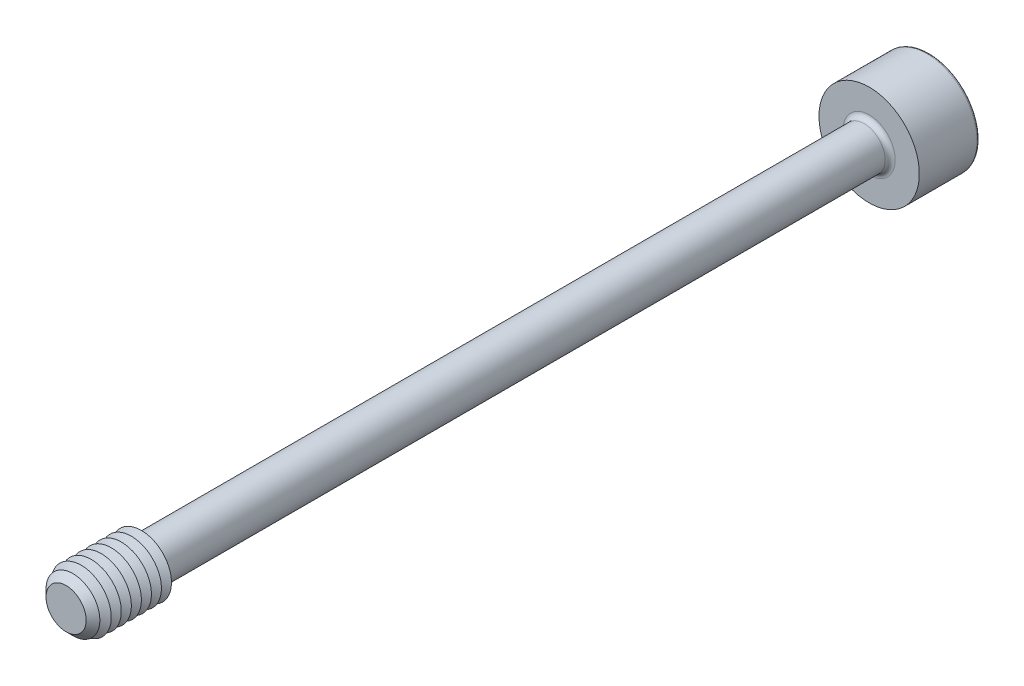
from build123d import *

# Parameters (mm, degrees)
SKETCH1_R       = 2.1
EXTRUDE1_DEPTH  = 40
CHAMFER1_SIZE   = 1
SKETCH3_R       = 5
EXTRUDE2_DEPTH  = 6
EXTRUDE3_DEPTH  = 5
FILLET1_R       = 0.5
FILLET2_R       = 0.25
LPATTERN1_COUNT = 7
LPATTERN1_PITCH = 1


with BuildPart() as part:
    # Sketch1 → Extrude1 (new, symmetric)
    with BuildSketch(Plane.XY):
        Circle(SKETCH1_R)
    extrude(amount=EXTRUDE1_DEPTH, both=True)

    # Sketch2 → Revolve1 (revolve)
    with BuildSketch(Plane(origin=(0, 0, 0), x_dir=(0, 0, -1), z_dir=(1, 0, 0))):
        Polygon((-40, 0), (-40, 3), (-32.5, 3), (-31.980384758, 2.1), (-31.980384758, 0), align=None)
    revolve(axis=Axis((0, 0, 31.980384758), (0, 0, 1)))

    # Chamfer1
    chamfer1_edges = [part.edges().sort_by_distance(p)[0] for p in [
        (0, -3, 40),
    ]]
    chamfer(chamfer1_edges, length=CHAMFER1_SIZE)

    # Sketch3 → Extrude2 (add)
    with BuildSketch(Plane(origin=(0, 0, -40), x_dir=(-1, 0, 0), z_dir=(0, 0, -1))):
        Circle(SKETCH3_R)
    extrude(amount=EXTRUDE2_DEPTH)

    # Sketch4 → Extrude3 (cut)
    with BuildSketch(Plane(origin=(-13.7, 0, -46), x_dir=(1, 0, 0), z_dir=(0, 0, 1))):
        Polygon((12.256624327, -2.5), (15.143375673, -2.5), (16.586751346, 0), (15.143375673, 2.5), (12.256624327, 2.5), (10.813248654, 0), align=None)
    extrude(amount=EXTRUDE3_DEPTH, mode=Mode.SUBTRACT)

    # Fillet1
    fillet1_edges = [part.edges().sort_by_distance(p)[0] for p in [
        (-2.1, 0, -40),
    ]]
    fillet(fillet1_edges, radius=FILLET1_R)

    # Fillet2
    fillet2_edges = [part.edges().sort_by_distance(p)[0] for p in [
        (5, 0, -46),
    ]]
    fillet(fillet2_edges, radius=FILLET2_R)

    # Sketch5 → Cut-Revolve1 (revolve, cut)
    with BuildSketch(Plane(origin=(0, 0, 0), x_dir=(0, 0, -1), z_dir=(1, 0, 0)), mode=Mode.PRIVATE) as cut_revolve1_sk:
        Polygon((41, 0), (41, -2.5), (39.556624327, 0), align=None)
    revolve(cut_revolve1_sk.sketch.rotate(Axis((0, 0, -39.556624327), (0, 0, -1)), 90), axis=Axis((0, 0, -39.556624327), (0, 0, -1)), mode=Mode.SUBTRACT)

    # Sketch7 → Cut-Revolve2 (revolve, cut)
    with BuildSketch(Plane(origin=(0, 0, 0), x_dir=(0, 0, -1), z_dir=(1, 0, 0)), mode=Mode.PRIVATE) as cut_revolve2_sk:
        Polygon((-32.5, 3), (-33, 2.133974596), (-33.5, 3), align=None)
    cut_revolve2 = revolve(cut_revolve2_sk.sketch.rotate(Axis((0, 0, -1.332048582), (0, 0, 1)), 90), axis=Axis((0, 0, -1.332048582), (0, 0, 1)), mode=Mode.SUBTRACT)

    # LPattern1: Cut-Revolve2 ×7
    with Locations(*[(0, 0, i * LPATTERN1_PITCH) for i in range(1, LPATTERN1_COUNT)]):
        add(cut_revolve2, mode=Mode.SUBTRACT)


solid = part.part
